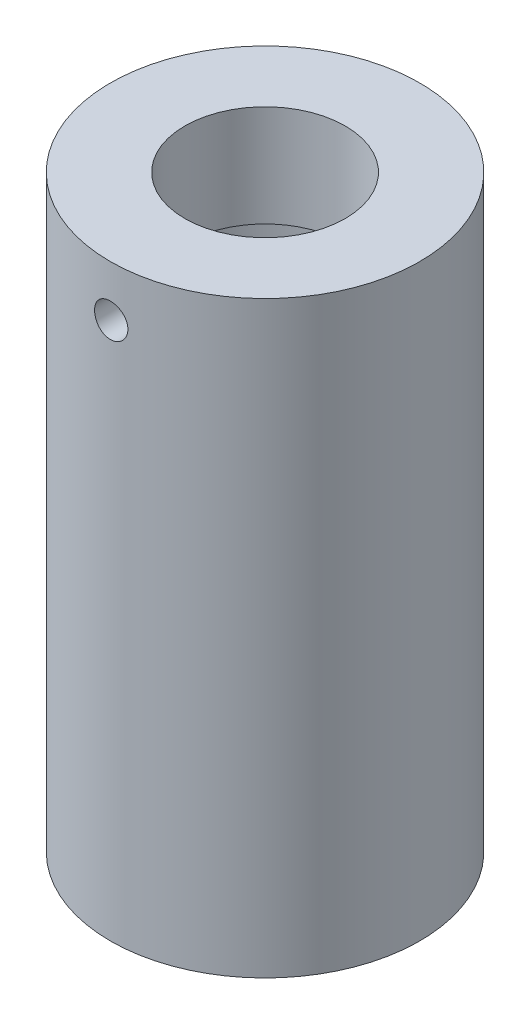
from build123d import *

# Parameters (mm, degrees)
CUT_EXTRUDE1_REACH = 78.528
SKETCH2_R          = 2.032


with BuildPart() as part:
    # Sketch1 → Base-Revolve (revolve)
    with BuildSketch(Plane.XY, mode=Mode.PRIVATE) as base_revolve_sk:
        Polygon((-9.779, 71.7296), (-9.779, 59.3598), (-16.49984, 59.3598), (-16.49984, 0), (-18.8595, 0), (-18.8595, 71.7296), align=None)
    revolve(base_revolve_sk.sketch.rotate(Axis((0, 93.98, 0), (0, -1, 0)), 270), axis=Axis((0, 93.98, 0), (0, -1, 0)))

    # Sketch2 → Cut-Extrude1 (cut, up to next)
    with BuildSketch(Plane.XY, mode=Mode.PRIVATE) as cut_extrude1_sk1:
        with Locations(Location((0, 65.532, 0), (0, 0, 180))):
            Circle(SKETCH2_R)
    cut_extrude1_tool1 = extrude(cut_extrude1_sk1.sketch, amount=CUT_EXTRUDE1_REACH, mode=Mode.PRIVATE) & part.part
    add(cut_extrude1_tool1.solids().sort_by_distance((0, 65.532, 0))[0], mode=Mode.SUBTRACT)


solid = part.part
